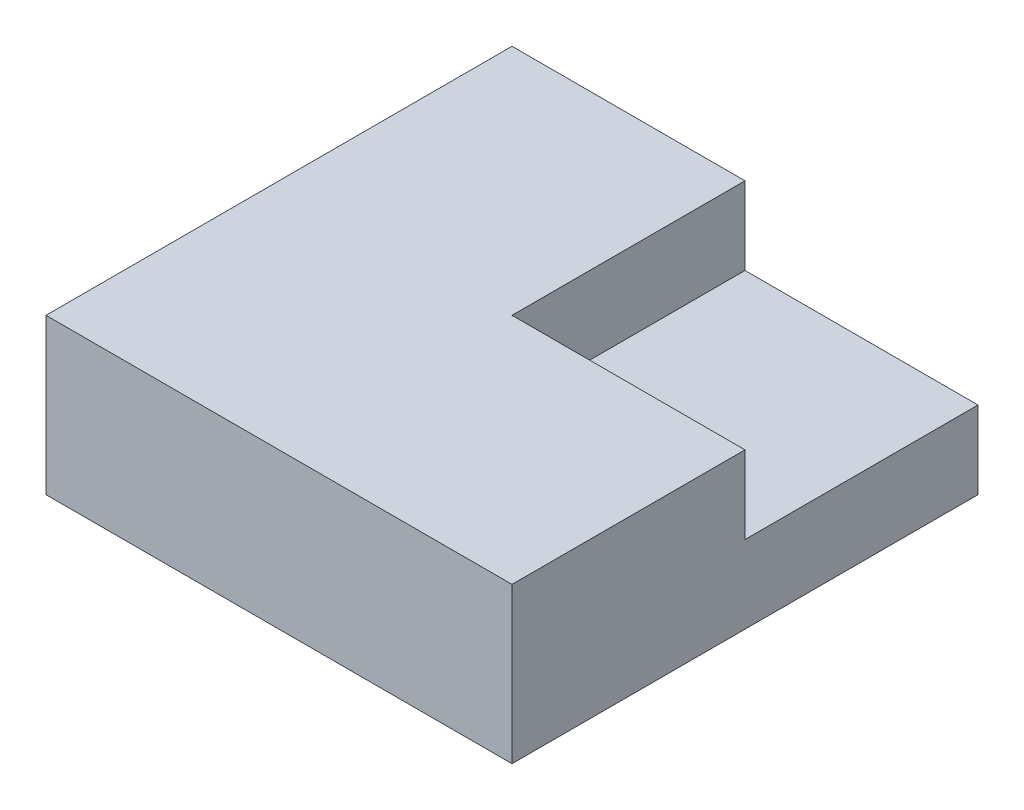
ISO-10303-21;
HEADER;
FILE_DESCRIPTION(('STEP AP214'),'2;1');
FILE_NAME('part.step','',(''),(''),'','','');
FILE_SCHEMA(('AUTOMOTIVE_DESIGN { 1 0 10303 214 1 1 1 1 }'));
ENDSEC;
DATA;
#1=APPLICATION_CONTEXT('core data for automotive mechanical design processes');
#2=APPLICATION_PROTOCOL_DEFINITION('international standard','automotive_design',2000,#1);
#3=PRODUCT_CONTEXT('',#1,'mechanical');
#4=PRODUCT('Part','Part','',(#3));
#5=PRODUCT_RELATED_PRODUCT_CATEGORY('part','',(#4));
#6=PRODUCT_DEFINITION_FORMATION('','',#4);
#7=PRODUCT_DEFINITION_CONTEXT('part definition',#1,'design');
#8=PRODUCT_DEFINITION('design','',#6,#7);
#9=PRODUCT_DEFINITION_SHAPE('','',#8);
#10=(LENGTH_UNIT() NAMED_UNIT(*) SI_UNIT(.MILLI.,.METRE.));
#11=(NAMED_UNIT(*) PLANE_ANGLE_UNIT() SI_UNIT($,.RADIAN.));
#12=(NAMED_UNIT(*) SI_UNIT($,.STERADIAN.) SOLID_ANGLE_UNIT());
#13=UNCERTAINTY_MEASURE_WITH_UNIT(LENGTH_MEASURE(1.E-05),#10,'distance_accuracy_value','');
#14=(GEOMETRIC_REPRESENTATION_CONTEXT(3) GLOBAL_UNCERTAINTY_ASSIGNED_CONTEXT((#13)) GLOBAL_UNIT_ASSIGNED_CONTEXT((#10,
#11,#12)) REPRESENTATION_CONTEXT('',''));
#15=CARTESIAN_POINT('',(0.,0.,0.));
#16=DIRECTION('',(0.,0.,1.));
#17=DIRECTION('',(1.,0.,0.));
#18=AXIS2_PLACEMENT_3D('',#15,#16,#17);
#19=CARTESIAN_POINT('',(0.,0.,30.));
#20=DIRECTION('',(1.,0.,0.));
#21=DIRECTION('',(0.,0.,-1.));
#22=AXIS2_PLACEMENT_3D('',#19,#20,#21);
#23=PLANE('',#22);
#24=DIRECTION('',(0.,-1.,0.));
#25=VECTOR('',#24,1.);
#26=CARTESIAN_POINT('',(0.,0.,0.));
#27=LINE('',#26,#25);
#28=CARTESIAN_POINT('',(0.,10.,0.));
#29=VERTEX_POINT('',#28);
#30=CARTESIAN_POINT('',(0.,0.,0.));
#31=VERTEX_POINT('',#30);
#32=EDGE_CURVE('E129',#29,#31,#27,.T.);
#33=ORIENTED_EDGE('',*,*,#32,.T.);
#34=DIRECTION('',(0.,0.,-1.));
#35=VECTOR('',#34,1.);
#36=CARTESIAN_POINT('',(0.,0.,30.));
#37=LINE('',#36,#35);
#38=CARTESIAN_POINT('',(0.,0.,30.));
#39=VERTEX_POINT('',#38);
#40=EDGE_CURVE('E11',#39,#31,#37,.T.);
#41=ORIENTED_EDGE('',*,*,#40,.F.);
#42=DIRECTION('',(0.,-1.,0.));
#43=VECTOR('',#42,1.);
#44=CARTESIAN_POINT('',(0.,0.,30.));
#45=LINE('',#44,#43);
#46=CARTESIAN_POINT('',(0.,10.,30.));
#47=VERTEX_POINT('',#46);
#48=EDGE_CURVE('E122',#47,#39,#45,.T.);
#49=ORIENTED_EDGE('',*,*,#48,.F.);
#50=DIRECTION('',(0.,0.,-1.));
#51=VECTOR('',#50,1.);
#52=CARTESIAN_POINT('',(0.,10.,30.));
#53=LINE('',#52,#51);
#54=EDGE_CURVE('E128',#47,#29,#53,.T.);
#55=ORIENTED_EDGE('',*,*,#54,.T.);
#56=EDGE_LOOP('',(#33,#41,#49,#55));
#57=FACE_BOUND('',#56,.T.);
#58=ADVANCED_FACE('F31',(#57),#23,.F.);
#59=CARTESIAN_POINT('',(0.,0.,30.));
#60=DIRECTION('',(0.,1.,0.));
#61=DIRECTION('',(0.,0.,1.));
#62=AXIS2_PLACEMENT_3D('',#59,#60,#61);
#63=PLANE('',#62);
#64=DIRECTION('',(1.,0.,0.));
#65=VECTOR('',#64,1.);
#66=CARTESIAN_POINT('',(0.,0.,0.));
#67=LINE('',#66,#65);
#68=CARTESIAN_POINT('',(30.,0.,0.));
#69=VERTEX_POINT('',#68);
#70=EDGE_CURVE('E132',#31,#69,#67,.T.);
#71=ORIENTED_EDGE('',*,*,#70,.T.);
#72=DIRECTION('',(0.,0.,-1.));
#73=VECTOR('',#72,1.);
#74=CARTESIAN_POINT('',(30.,0.,30.));
#75=LINE('',#74,#73);
#76=CARTESIAN_POINT('',(30.,0.,30.));
#77=VERTEX_POINT('',#76);
#78=EDGE_CURVE('E38',#77,#69,#75,.T.);
#79=ORIENTED_EDGE('',*,*,#78,.F.);
#80=DIRECTION('',(1.,0.,0.));
#81=VECTOR('',#80,1.);
#82=CARTESIAN_POINT('',(0.,0.,30.));
#83=LINE('',#82,#81);
#84=EDGE_CURVE('E79',#39,#77,#83,.T.);
#85=ORIENTED_EDGE('',*,*,#84,.F.);
#86=ORIENTED_EDGE('',*,*,#40,.T.);
#87=EDGE_LOOP('',(#71,#79,#85,#86));
#88=FACE_BOUND('',#87,.T.);
#89=ADVANCED_FACE('F146',(#88),#63,.F.);
#90=CARTESIAN_POINT('',(30.,0.,30.));
#91=DIRECTION('',(-1.,0.,0.));
#92=DIRECTION('',(0.,0.,1.));
#93=AXIS2_PLACEMENT_3D('',#90,#91,#92);
#94=PLANE('',#93);
#95=DIRECTION('',(0.,0.,-1.));
#96=VECTOR('',#95,1.);
#97=CARTESIAN_POINT('',(30.,5.,0.));
#98=LINE('',#97,#96);
#99=CARTESIAN_POINT('',(30.,5.,15.));
#100=VERTEX_POINT('',#99);
#101=CARTESIAN_POINT('',(30.,5.,0.));
#102=VERTEX_POINT('',#101);
#103=EDGE_CURVE('E45',#100,#102,#98,.T.);
#104=ORIENTED_EDGE('',*,*,#103,.F.);
#105=DIRECTION('',(0.,1.,0.));
#106=VECTOR('',#105,1.);
#107=CARTESIAN_POINT('',(30.,5.,15.));
#108=LINE('',#107,#106);
#109=CARTESIAN_POINT('',(30.,10.,15.));
#110=VERTEX_POINT('',#109);
#111=EDGE_CURVE('E117',#100,#110,#108,.T.);
#112=ORIENTED_EDGE('',*,*,#111,.T.);
#113=DIRECTION('',(0.,0.,-1.));
#114=VECTOR('',#113,1.);
#115=CARTESIAN_POINT('',(30.,10.,30.));
#116=LINE('',#115,#114);
#117=CARTESIAN_POINT('',(30.,10.,30.));
#118=VERTEX_POINT('',#117);
#119=EDGE_CURVE('E138',#118,#110,#116,.T.);
#120=ORIENTED_EDGE('',*,*,#119,.F.);
#121=DIRECTION('',(0.,1.,0.));
#122=VECTOR('',#121,1.);
#123=CARTESIAN_POINT('',(30.,0.,30.));
#124=LINE('',#123,#122);
#125=EDGE_CURVE('E125',#77,#118,#124,.T.);
#126=ORIENTED_EDGE('',*,*,#125,.F.);
#127=ORIENTED_EDGE('',*,*,#78,.T.);
#128=DIRECTION('',(0.,1.,0.));
#129=VECTOR('',#128,1.);
#130=CARTESIAN_POINT('',(30.,0.,0.));
#131=LINE('',#130,#129);
#132=EDGE_CURVE('E134',#69,#102,#131,.T.);
#133=ORIENTED_EDGE('',*,*,#132,.T.);
#134=EDGE_LOOP('',(#104,#112,#120,#126,#127,#133));
#135=FACE_BOUND('',#134,.T.);
#136=ADVANCED_FACE('F143',(#135),#94,.F.);
#137=CARTESIAN_POINT('',(0.,10.,30.));
#138=DIRECTION('',(0.,-1.,0.));
#139=DIRECTION('',(0.,0.,-1.));
#140=AXIS2_PLACEMENT_3D('',#137,#138,#139);
#141=PLANE('',#140);
#142=ORIENTED_EDGE('',*,*,#119,.T.);
#143=DIRECTION('',(1.,0.,0.));
#144=VECTOR('',#143,1.);
#145=CARTESIAN_POINT('',(30.,10.,15.));
#146=LINE('',#145,#144);
#147=CARTESIAN_POINT('',(15.,10.,15.));
#148=VERTEX_POINT('',#147);
#149=EDGE_CURVE('E151',#148,#110,#146,.T.);
#150=ORIENTED_EDGE('',*,*,#149,.F.);
#151=DIRECTION('',(0.,0.,1.));
#152=VECTOR('',#151,1.);
#153=CARTESIAN_POINT('',(15.,10.,0.));
#154=LINE('',#153,#152);
#155=CARTESIAN_POINT('',(15.,10.,0.));
#156=VERTEX_POINT('',#155);
#157=EDGE_CURVE('E156',#156,#148,#154,.T.);
#158=ORIENTED_EDGE('',*,*,#157,.F.);
#159=DIRECTION('',(-1.,0.,0.));
#160=VECTOR('',#159,1.);
#161=CARTESIAN_POINT('',(0.,10.,0.));
#162=LINE('',#161,#160);
#163=EDGE_CURVE('E72',#156,#29,#162,.T.);
#164=ORIENTED_EDGE('',*,*,#163,.T.);
#165=ORIENTED_EDGE('',*,*,#54,.F.);
#166=DIRECTION('',(-1.,0.,0.));
#167=VECTOR('',#166,1.);
#168=CARTESIAN_POINT('',(0.,10.,30.));
#169=LINE('',#168,#167);
#170=EDGE_CURVE('E54',#118,#47,#169,.T.);
#171=ORIENTED_EDGE('',*,*,#170,.F.);
#172=EDGE_LOOP('',(#142,#150,#158,#164,#165,#171));
#173=FACE_BOUND('',#172,.T.);
#174=ADVANCED_FACE('F149',(#173),#141,.F.);
#175=CARTESIAN_POINT('',(0.,10.,30.));
#176=DIRECTION('',(0.,0.,-1.));
#177=DIRECTION('',(-1.,0.,0.));
#178=AXIS2_PLACEMENT_3D('',#175,#176,#177);
#179=PLANE('',#178);
#180=ORIENTED_EDGE('',*,*,#48,.T.);
#181=ORIENTED_EDGE('',*,*,#84,.T.);
#182=ORIENTED_EDGE('',*,*,#125,.T.);
#183=ORIENTED_EDGE('',*,*,#170,.T.);
#184=EDGE_LOOP('',(#180,#181,#182,#183));
#185=FACE_BOUND('',#184,.T.);
#186=ADVANCED_FACE('F166',(#185),#179,.F.);
#187=CARTESIAN_POINT('',(0.,10.,0.));
#188=DIRECTION('',(0.,0.,-1.));
#189=DIRECTION('',(-1.,0.,0.));
#190=AXIS2_PLACEMENT_3D('',#187,#188,#189);
#191=PLANE('',#190);
#192=DIRECTION('',(0.,1.,0.));
#193=VECTOR('',#192,1.);
#194=CARTESIAN_POINT('',(15.,5.,0.));
#195=LINE('',#194,#193);
#196=CARTESIAN_POINT('',(15.,5.,0.));
#197=VERTEX_POINT('',#196);
#198=EDGE_CURVE('E103',#197,#156,#195,.T.);
#199=ORIENTED_EDGE('',*,*,#198,.F.);
#200=DIRECTION('',(-1.,0.,0.));
#201=VECTOR('',#200,1.);
#202=CARTESIAN_POINT('',(30.,5.,0.));
#203=LINE('',#202,#201);
#204=EDGE_CURVE('E107',#102,#197,#203,.T.);
#205=ORIENTED_EDGE('',*,*,#204,.F.);
#206=ORIENTED_EDGE('',*,*,#132,.F.);
#207=ORIENTED_EDGE('',*,*,#70,.F.);
#208=ORIENTED_EDGE('',*,*,#32,.F.);
#209=ORIENTED_EDGE('',*,*,#163,.F.);
#210=EDGE_LOOP('',(#199,#205,#206,#207,#208,#209));
#211=FACE_BOUND('',#210,.T.);
#212=ADVANCED_FACE('F114',(#211),#191,.T.);
#213=CARTESIAN_POINT('',(30.,5.,15.));
#214=DIRECTION('',(0.,0.,1.));
#215=DIRECTION('',(1.,0.,0.));
#216=AXIS2_PLACEMENT_3D('',#213,#214,#215);
#217=PLANE('',#216);
#218=ORIENTED_EDGE('',*,*,#149,.T.);
#219=ORIENTED_EDGE('',*,*,#111,.F.);
#220=DIRECTION('',(1.,0.,0.));
#221=VECTOR('',#220,1.);
#222=CARTESIAN_POINT('',(30.,5.,15.));
#223=LINE('',#222,#221);
#224=CARTESIAN_POINT('',(15.,5.,15.));
#225=VERTEX_POINT('',#224);
#226=EDGE_CURVE('E106',#225,#100,#223,.T.);
#227=ORIENTED_EDGE('',*,*,#226,.F.);
#228=DIRECTION('',(0.,1.,0.));
#229=VECTOR('',#228,1.);
#230=CARTESIAN_POINT('',(15.,5.,15.));
#231=LINE('',#230,#229);
#232=EDGE_CURVE('E104',#225,#148,#231,.T.);
#233=ORIENTED_EDGE('',*,*,#232,.T.);
#234=EDGE_LOOP('',(#218,#219,#227,#233));
#235=FACE_BOUND('',#234,.T.);
#236=ADVANCED_FACE('F158',(#235),#217,.F.);
#237=CARTESIAN_POINT('',(15.,5.,0.));
#238=DIRECTION('',(-1.,0.,0.));
#239=DIRECTION('',(0.,0.,1.));
#240=AXIS2_PLACEMENT_3D('',#237,#238,#239);
#241=PLANE('',#240);
#242=ORIENTED_EDGE('',*,*,#157,.T.);
#243=ORIENTED_EDGE('',*,*,#232,.F.);
#244=DIRECTION('',(0.,0.,1.));
#245=VECTOR('',#244,1.);
#246=CARTESIAN_POINT('',(15.,5.,0.));
#247=LINE('',#246,#245);
#248=EDGE_CURVE('E99',#197,#225,#247,.T.);
#249=ORIENTED_EDGE('',*,*,#248,.F.);
#250=ORIENTED_EDGE('',*,*,#198,.T.);
#251=EDGE_LOOP('',(#242,#243,#249,#250));
#252=FACE_BOUND('',#251,.T.);
#253=ADVANCED_FACE('F101',(#252),#241,.F.);
#254=CARTESIAN_POINT('',(30.,5.,0.));
#255=DIRECTION('',(0.,-1.,0.));
#256=DIRECTION('',(0.,0.,-1.));
#257=AXIS2_PLACEMENT_3D('',#254,#255,#256);
#258=PLANE('',#257);
#259=ORIENTED_EDGE('',*,*,#103,.T.);
#260=ORIENTED_EDGE('',*,*,#204,.T.);
#261=ORIENTED_EDGE('',*,*,#248,.T.);
#262=ORIENTED_EDGE('',*,*,#226,.T.);
#263=EDGE_LOOP('',(#259,#260,#261,#262));
#264=FACE_BOUND('',#263,.T.);
#265=ADVANCED_FACE('F109',(#264),#258,.F.);
#266=CLOSED_SHELL('',(#58,#89,#136,#174,#186,#212,#236,#253,#265));
#267=MANIFOLD_SOLID_BREP('B2',#266);
#268=ADVANCED_BREP_SHAPE_REPRESENTATION('',(#18,#267),#14);
#269=SHAPE_DEFINITION_REPRESENTATION(#9,#268);
ENDSEC;
END-ISO-10303-21;
